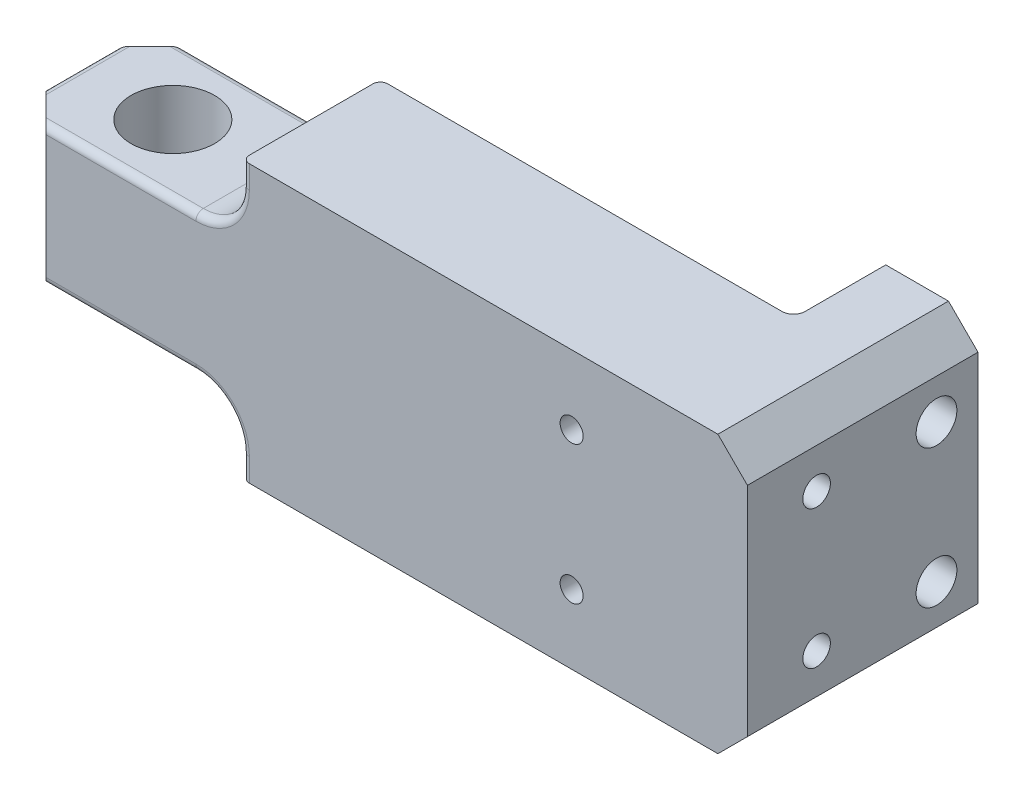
from build123d import *

# Parameters (mm, degrees)
BASE_EXTRUDE_DEPTH               = 9.525
BASE_EXTRUDE_DEPTH_BACK          = 9.525
CHAMFER1_SIZE                    = 4.064
CHAMFER2_SIZE                    = 4.7625
FILLET1_R                        = 1.016
F_29_64_0_45313_DIAMETER_HOLE1_D = 11.509502
F_10_24_TAPPED_HOLE1_D           = 3.7973
F_10_24_TAPPED_HOLE1_DEPTH       = 24.3459
F_10_24_TAPPED_HOLE1_TIP         = 1.140824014
EXTRUDE1_DEPTH                   = 12.7
FILLET2_R                        = 1.5875
SKETCH12_R                       = 2.8067
CUT_EXTRUDE1_DEPTH               = 106.488695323
SKETCH13_R                       = 1.5875
CUT_EXTRUDE2_DEPTH               = 105.865708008


with BuildPart() as part:
    # Sketch1 → Base-Extrude (new, two sides: drawn at the far end of the back side and taken through both)
    with BuildSketch(Plane.XY.offset(-BASE_EXTRUDE_DEPTH_BACK)):
        with BuildLine():
            Line((0, -9.525), (0, 9.525))
            Line((0, 9.525), (25.4, 9.525))
            ThreePointArc((25.4, 9.525), (29.890128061, 11.384871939), (31.75, 15.875))
            Line((31.75, 15.875), (31.75, 19.05))
            Line((31.75, 19.05), (101.346, 19.05))
            Line((101.346, 19.05), (101.346, -19.05))
            Line((101.346, -19.05), (31.75, -19.05))
            Line((31.75, -19.05), (31.75, -15.875))
            ThreePointArc((31.75, -15.875), (29.890128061, -11.384871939), (25.4, -9.525))
            Line((25.4, -9.525), (0, -9.525))
        make_face()
    extrude(amount=BASE_EXTRUDE_DEPTH + BASE_EXTRUDE_DEPTH_BACK)

    # Chamfer1
    chamfer1_edges = [part.edges().sort_by_distance(p)[0] for p in [
        (101.346, 19.05, 0),
        (101.346, -19.05, 0),
    ]]
    chamfer(chamfer1_edges, length=CHAMFER1_SIZE)

    # Chamfer2
    chamfer2_edges = [part.edges().sort_by_distance(p)[0] for p in [
        (0, 0, 9.525),
        (0, 0, -9.525),
    ]]
    chamfer(chamfer2_edges, length=CHAMFER2_SIZE)

    # Fillet1
    fillet1_edges = [part.edges().sort_by_distance(p)[0] for p in [
        (29.890128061, -11.384871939, 9.525),
        (31.75, -17.4625, 9.525),
        (29.890128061, 11.384871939, -9.525),
        (31.75, 17.4625, -9.525),
        (31.75, -17.4625, -9.525),
        (29.890128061, -11.384871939, -9.525),
        (15.08125, 9.525, -9.525),
        (31.75, 17.4625, 9.525),
        (29.890128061, 11.384871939, 9.525),
        (0, 9.525, 0),
        (0, -9.525, 0),
        (15.08125, -9.525, -9.525),
        (15.08125, -9.525, 9.525),
        (15.08125, 9.525, 9.525),
    ]]
    fillet(fillet1_edges, radius=FILLET1_R)

    # 29_64 _0.45313_ Diameter Hole1 (through all)
    with Locations(Plane(origin=(0, 9.525, 0), x_dir=(-1, 0, 0), z_dir=(0, 1, 0))):
        with Locations((-12.7, 0)):
            Hole(F_29_64_0_45313_DIAMETER_HOLE1_D / 2)

    # 10-24 Tapped Hole1
    with Locations(Plane(origin=(101.346, 0, 0), x_dir=(0, 0, -1), z_dir=(1, 0, 0))):
        with Locations((0, 9.525), (0, -9.525)):
            Hole(F_10_24_TAPPED_HOLE1_D / 2, depth=F_10_24_TAPPED_HOLE1_DEPTH)
            with Locations((0, 0, -(F_10_24_TAPPED_HOLE1_DEPTH + F_10_24_TAPPED_HOLE1_TIP / 2))):  # 118° drill point
                Cone(0, F_10_24_TAPPED_HOLE1_D / 2, F_10_24_TAPPED_HOLE1_TIP, mode=Mode.SUBTRACT)

    # Sketch11 → Extrude1 (add)
    with BuildSketch(Plane(origin=(0, 0, -9.525), x_dir=(-1, 0, 0), z_dir=(0, 0, -1))):
        Polygon((-88.646, 19.05), (-88.646, -19.05), (-97.282, -19.05), (-101.346, -14.986), (-101.346, 14.986), (-97.282, 19.05), align=None)
    extrude(amount=EXTRUDE1_DEPTH)

    # Fillet2
    fillet2_edges = [part.edges().sort_by_distance(p)[0] for p in [
        (88.646, 0, -9.525),
    ]]
    fillet(fillet2_edges, radius=FILLET2_R)

    # Sketch12 → Cut-Extrude1 (cut, through all)
    with BuildSketch(Plane(origin=(101.346, 0, 0), x_dir=(0, 0, -1), z_dir=(1, 0, 0))):
        with Locations((16.51, 9.525)):
            Circle(SKETCH12_R)
        with Locations((16.51, -9.525)):
            Circle(SKETCH12_R)
    extrude(amount=-CUT_EXTRUDE1_DEPTH, mode=Mode.SUBTRACT)

    # Sketch13 → Cut-Extrude2 (cut, through all)
    with BuildSketch(Plane(origin=(0, 0, -9.525), x_dir=(-1, 0, 0), z_dir=(0, 0, -1))):
        with Locations((-77.1398, -9.525)):
            Circle(SKETCH13_R)
        with Locations((-77.1398, 9.525)):
            Circle(SKETCH13_R)
    extrude(amount=-CUT_EXTRUDE2_DEPTH, mode=Mode.SUBTRACT)


solid = part.part
